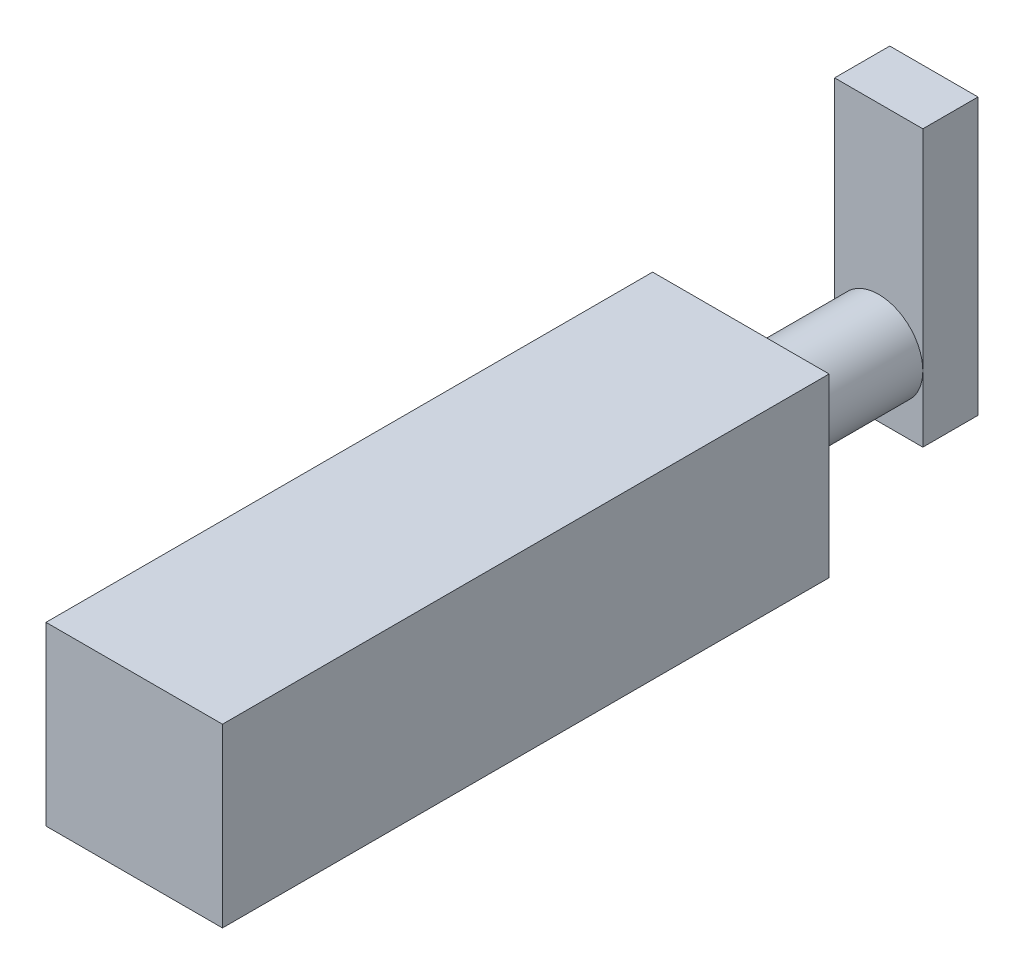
from build123d import *

# Parameters (mm, degrees)
ESQUISSE1_R        = 8
BOSS_EXTRU_1_DEPTH = 80
ESQUISSE2_W        = 16
ESQUISSE2_H        = 50
BOSS_EXTRU_2_DEPTH = 10
ESQUISSE6_W        = 32
ESQUISSE6_H        = 32
BOSS_EXTRU_3_DEPTH = 55


with BuildPart() as part:
    # Esquisse1 → Boss.-Extru.1 (new body)
    with BuildSketch(Plane.XY):
        Circle(ESQUISSE1_R)
    extrude(amount=BOSS_EXTRU_1_DEPTH)

    # Esquisse2 → Boss.-Extru.2 (add)
    with BuildSketch(Plane(origin=(0, 0, 0), x_dir=(-1, 0, 0), z_dir=(0, 0, -1))):
        with Locations((0, 13)):
            Rectangle(ESQUISSE2_W, ESQUISSE2_H)
    extrude(amount=BOSS_EXTRU_2_DEPTH)

    # Esquisse6 → Boss.-Extru.3 (add, symmetric)
    with BuildSketch(Plane.XY.offset(80)):
        Rectangle(ESQUISSE6_W, ESQUISSE6_H)
    extrude(amount=BOSS_EXTRU_3_DEPTH, both=True)


solid = part.part
